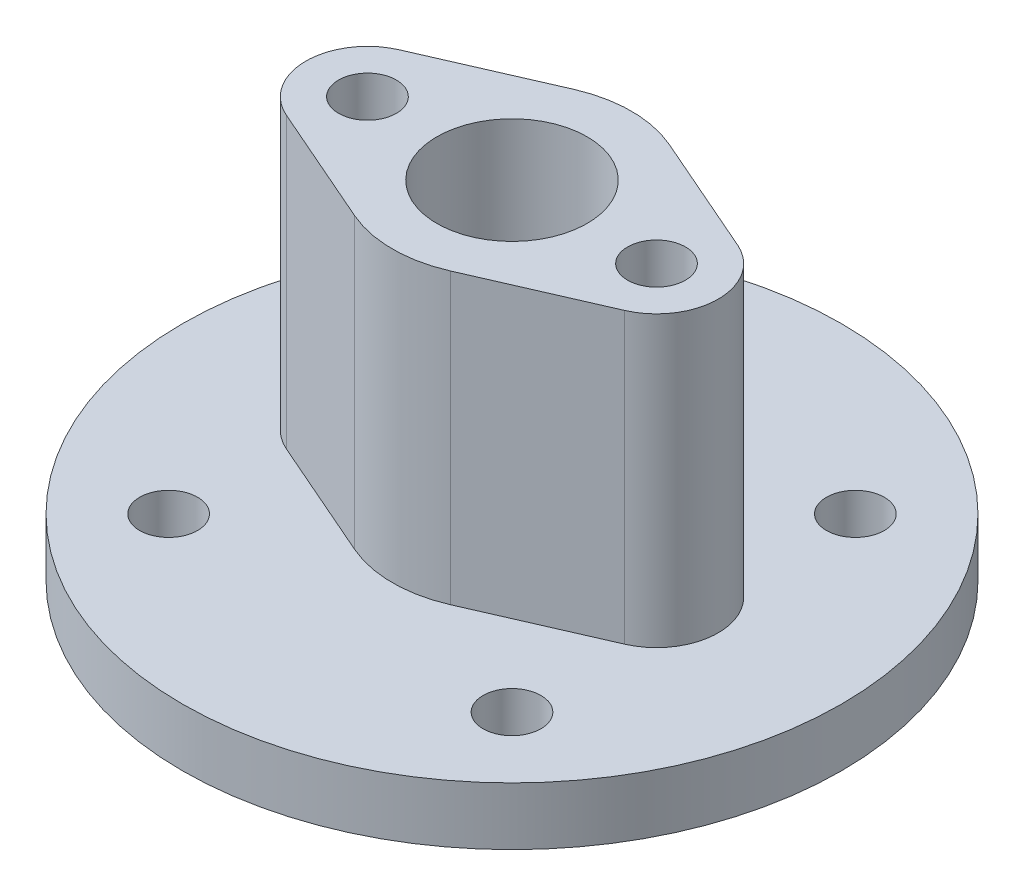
from build123d import *

# Parameters (mm, degrees)
BOSS_EXTRUDE1_DEPTH            = 75
F_15_0_15_DIAMETER_HOLE1_D     = 15
CIRPATTERN1_COUNT              = 4
F_15_0_15_DIAMETER_HOLE2_D     = 15
F_15_0_15_DIAMETER_HOLE2_DEPTH = 25
F_15_0_15_DIAMETER_HOLE2_TIP   = 4.506454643


with BuildPart() as part:
    # Sketch1 → Revolve1 (revolve)
    with BuildSketch(Plane.XY, mode=Mode.PRIVATE) as revolve1_sk:
        Polygon((0, 0), (0, 57), (85.5, 57), (85.5, 42), (42, 42), (24, 0), align=None)
    revolve(revolve1_sk.sketch.rotate(Axis((0, 68.695194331, 0), (0, -1, 0)), 90), axis=Axis((0, 68.695194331, 0), (0, -1, 0)))

    # Sketch2 → Boss-Extrude1 (add)
    with BuildSketch(Plane(origin=(0, 57, 0), x_dir=(1, 0, 0), z_dir=(0, 1, 0))):
        with BuildLine():
            Line((-43.9, 14.664242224), (-12.4, 28.411969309))
            ThreePointArc((-12.4, 28.411969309), (0, 31), (12.4, 28.411969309))
            Line((12.4, 28.411969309), (43.9, 14.664242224))
            ThreePointArc((43.9, 14.664242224), (53.5, 0), (43.9, -14.664242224))
            Line((43.9, -14.664242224), (12.4, -28.411969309))
            ThreePointArc((12.4, -28.411969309), (0, -31), (-12.4, -28.411969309))
            Line((-12.4, -28.411969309), (-43.9, -14.664242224))
            ThreePointArc((-43.9, -14.664242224), (-53.5, 0), (-43.9, 14.664242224))
        make_face()
    extrude(amount=BOSS_EXTRUDE1_DEPTH)

    # Sketch3 → Cut-Revolve1 (revolve, cut)
    with BuildSketch(Plane.XY, mode=Mode.PRIVATE) as cut_revolve1_sk:
        Polygon((0, 132), (19.5, 132), (19.5, 102), (10.5, 102), (10.5, 90), (19.5, 90), (19.5, 66), (13.5, 66), (13.5, 0), (0, 0), align=None)
    revolve(cut_revolve1_sk.sketch.rotate(Axis((0, -11.196202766, 0), (0, 1, 0)), 90), axis=Axis((0, -11.196202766, 0), (0, 1, 0)), mode=Mode.SUBTRACT)

    # 15.0 _15_ Diameter Hole1 (through all)
    with Locations(Plane(origin=(0, 57, 0), x_dir=(-1, 0, 0), z_dir=(0, 1, 0))):
        with Locations((44.547727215, 44.547727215)):
            f_15_0_15_diameter_hole1 = Hole(F_15_0_15_DIAMETER_HOLE1_D / 2)

    # CirPattern1: 15.0 _15_ Diameter Hole1 ×4 about axis
    cirpattern1_axis = Axis((0, 0, 0), (0, 1, 0))
    for i in range(1, CIRPATTERN1_COUNT):
        add(f_15_0_15_diameter_hole1.rotate(cirpattern1_axis, i * 360 / CIRPATTERN1_COUNT), mode=Mode.SUBTRACT)

    # 15.0 _15_ Diameter Hole2
    with Locations(Plane(origin=(0, 132, 0), x_dir=(-1, 0, 0), z_dir=(0, 1, 0))):
        with Locations((37.5, 0), (-37.5, 0)):
            Hole(F_15_0_15_DIAMETER_HOLE2_D / 2, depth=F_15_0_15_DIAMETER_HOLE2_DEPTH)
            with Locations((0, 0, -(F_15_0_15_DIAMETER_HOLE2_DEPTH + F_15_0_15_DIAMETER_HOLE2_TIP / 2))):  # 118° drill point
                Cone(0, F_15_0_15_DIAMETER_HOLE2_D / 2, F_15_0_15_DIAMETER_HOLE2_TIP, mode=Mode.SUBTRACT)


solid = part.part
